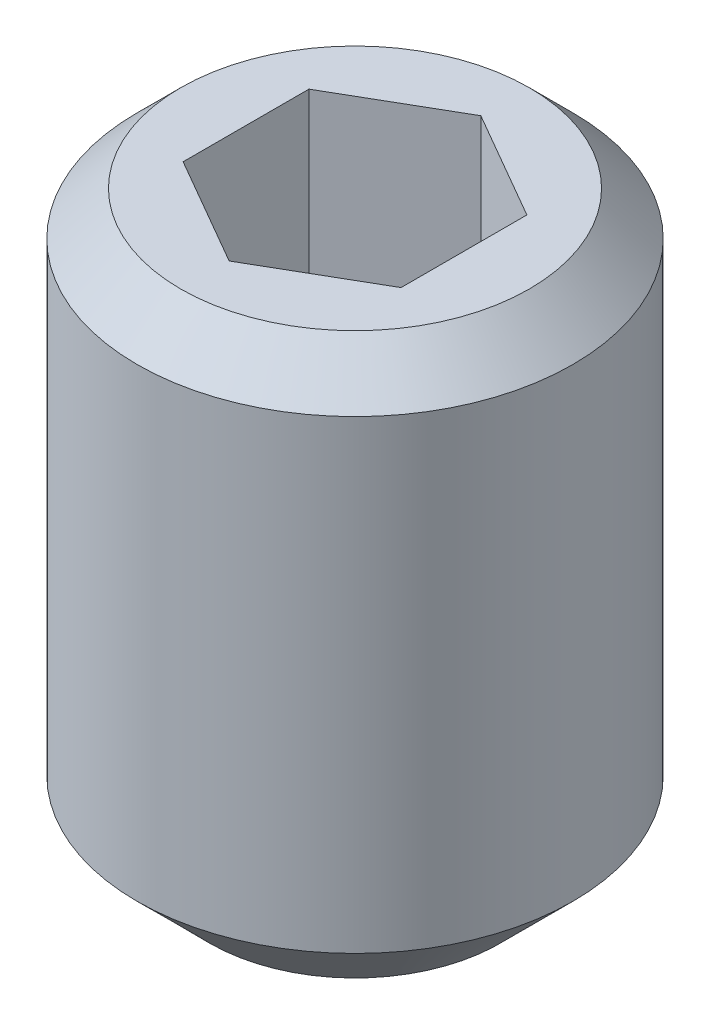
from build123d import *

# Parameters (mm, degrees)
ENL_V_MAT_EXTRU_1_DEPTH = 1.5


with BuildPart() as part:
    # Esquisse1 → Base-R_volution (revolve)
    with BuildSketch(Plane.XY, mode=Mode.PRIVATE) as base_r_volution_sk:
        Polygon((0.75, 0), (1.2, 0), (1.5, -0.3), (1.5, -3.5), (1, -4), (0, -4), (0, -1.933012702), (0.75, -1.5), align=None)
    revolve(base_r_volution_sk.sketch.rotate(Axis((0, -4, 0), (0, 1, 0)), 90), axis=Axis((0, -4, 0), (0, 1, 0)))

    # Esquisse2 → Enl_v. mat.-Extru.1 (cut)
    with BuildSketch(Plane(origin=(0, 0, 0), x_dir=(-1, 0, 0), z_dir=(0, 1, 0))):
        Polygon((0.75, -0.433012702), (0.75, 0.433012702), (0, 0.866025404), (-0.75, 0.433012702), (-0.75, -0.433012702), (0, -0.866025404), align=None)
    extrude(amount=-ENL_V_MAT_EXTRU_1_DEPTH, mode=Mode.SUBTRACT)


solid = part.part
